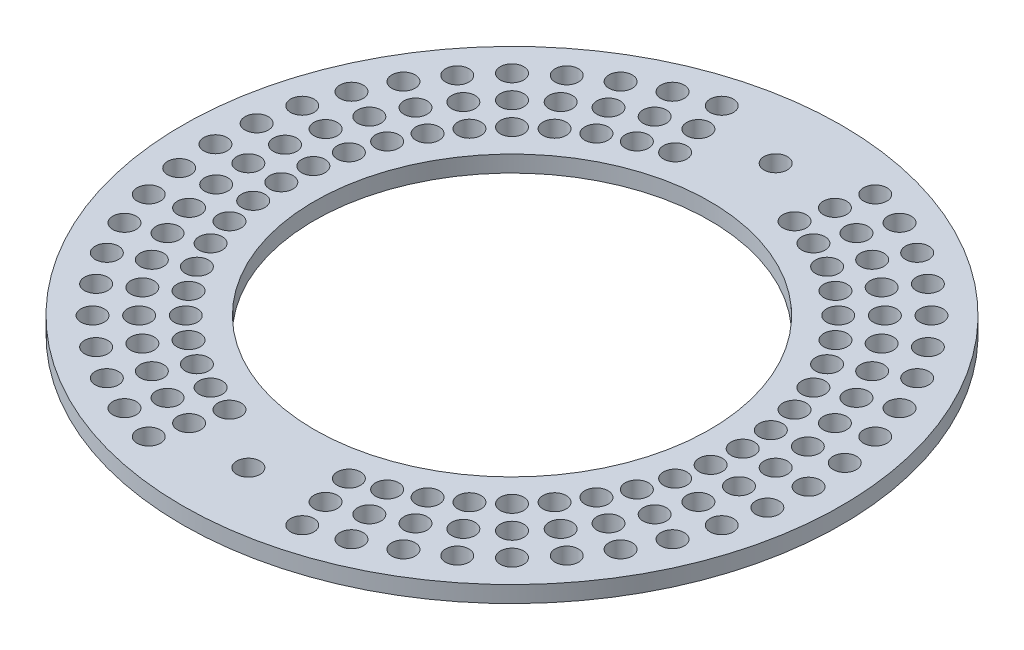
from build123d import *

# Parameters (mm, degrees)
SKETCH1_R                = 63.5
SKETCH1_R_2              = 38.1
BOSS_EXTRUDE1_DEPTH      = 3.175
SKETCH2_R                = 2.2479
CUT_EXTRUDE1_DEPTH       = 90.858670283
SKETCH3_R                = 2.2479
CUT_EXTRUDE2_DEPTH       = 90.858670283
CIRPATTERN1_COUNT        = 21
CIRPATTERN1_ANGLE        = 150
MIRROR1_COPY_1_SKETCH_R  = 2.2479
MIRROR1_COPY_1_DEPTH     = 90.858670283
MIRROR1_COPY_2_SKETCH_R  = 2.2479
MIRROR1_COPY_2_DEPTH     = 90.858670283
MIRROR1_COPY_3_SKETCH_R  = 2.2479
MIRROR1_COPY_3_DEPTH     = 90.858670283
MIRROR1_COPY_4_SKETCH_R  = 2.2479
MIRROR1_COPY_4_DEPTH     = 90.858670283
MIRROR1_COPY_5_SKETCH_R  = 2.2479
MIRROR1_COPY_5_DEPTH     = 90.858670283
MIRROR1_COPY_6_SKETCH_R  = 2.2479
MIRROR1_COPY_6_DEPTH     = 90.858670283
MIRROR1_COPY_7_SKETCH_R  = 2.2479
MIRROR1_COPY_7_DEPTH     = 90.858670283
MIRROR1_COPY_8_SKETCH_R  = 2.2479
MIRROR1_COPY_8_DEPTH     = 90.858670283
MIRROR1_COPY_9_SKETCH_R  = 2.2479
MIRROR1_COPY_9_DEPTH     = 90.858670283
MIRROR1_COPY_10_SKETCH_R = 2.2479
MIRROR1_COPY_10_DEPTH    = 90.858670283
MIRROR1_COPY_11_SKETCH_R = 2.2479
MIRROR1_COPY_11_DEPTH    = 90.858670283
MIRROR1_COPY_12_SKETCH_R = 2.2479
MIRROR1_COPY_12_DEPTH    = 90.858670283
MIRROR1_COPY_13_SKETCH_R = 2.2479
MIRROR1_COPY_13_DEPTH    = 90.858670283
MIRROR1_COPY_14_SKETCH_R = 2.2479
MIRROR1_COPY_14_DEPTH    = 90.858670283
MIRROR1_COPY_15_SKETCH_R = 2.2479
MIRROR1_COPY_15_DEPTH    = 90.858670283
MIRROR1_COPY_16_SKETCH_R = 2.2479
MIRROR1_COPY_16_DEPTH    = 90.858670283
MIRROR1_COPY_17_SKETCH_R = 2.2479
MIRROR1_COPY_17_DEPTH    = 90.858670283
MIRROR1_COPY_18_SKETCH_R = 2.2479
MIRROR1_COPY_18_DEPTH    = 90.858670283
MIRROR1_COPY_19_SKETCH_R = 2.2479
MIRROR1_COPY_19_DEPTH    = 90.858670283
MIRROR1_COPY_20_SKETCH_R = 2.2479
MIRROR1_COPY_20_DEPTH    = 90.858670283


with BuildPart() as part:
    # Sketch1 → Boss-Extrude1 (new body)
    with BuildSketch(Plane(origin=(0, 0, 0), x_dir=(1, 0, 0), z_dir=(0, 1, 0))):
        with Locations(Location((0, 0, 0), (0, 0, 270))):
            Circle(SKETCH1_R)
        with Locations(Location((0, 0, 0), (0, 0, 270))):
            Circle(SKETCH1_R_2, mode=Mode.SUBTRACT)
    extrude(amount=BOSS_EXTRUDE1_DEPTH)

    # Sketch2 → Cut-Extrude1 (cut, through all)
    with BuildSketch(Plane(origin=(0, 3.175, 0), x_dir=(1, 0, 0), z_dir=(0, 1, 0))):
        with Locations(Location((0, 50.8, 0), (0, 0, 270))):
            Circle(SKETCH2_R)
        with Locations(Location((0, -50.8, 0), (0, 0, 270))):
            Circle(SKETCH2_R)
    extrude(amount=-CUT_EXTRUDE1_DEPTH, mode=Mode.SUBTRACT)

    # Sketch3 → Cut-Extrude2 (cut, through all)
    with BuildSketch(Plane(origin=(0, 3.175, 0), x_dir=(1, 0, 0), z_dir=(0, 1, 0))):
        with Locations(Location((-14.791508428, 55.202660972, 0), (0, 0, 270))):
            Circle(SKETCH3_R)
        with Locations(Location((-13.148007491, 49.069031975, 0), (0, 0, 270))):
            Circle(SKETCH3_R)
        with Locations(Location((-11.504506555, 42.935402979, 0), (0, 0, 270))):
            Circle(SKETCH3_R)
    cut_extrude2 = extrude(amount=-CUT_EXTRUDE2_DEPTH, mode=Mode.SUBTRACT)

    # CirPattern1: Cut-Extrude2 ×21 about axis
    cirpattern1_axis = Axis((0, 0, 0), (0, 1, 0))
    for i in range(1, CIRPATTERN1_COUNT):
        add(cut_extrude2.rotate(cirpattern1_axis, i * CIRPATTERN1_ANGLE / (CIRPATTERN1_COUNT - 1)), mode=Mode.SUBTRACT)

    # Mirror1: Cut-Extrude2 across plane
    add(cut_extrude2.mirror(Plane(origin=(0, 0, 0), x_dir=(0, 0, 1), z_dir=(1, 0, 0))), mode=Mode.SUBTRACT)

    # Mirror1 copy 1 sketch → Mirror1 copy 1 (cut, through all)
    with BuildSketch(Plane(origin=(0, 3.175, 0), x_dir=(-0.9914448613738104, 0, -0.13052619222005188), z_dir=(0, 1, 0))):
        with Locations((-14.791508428, -55.202660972)):
            Circle(MIRROR1_COPY_1_SKETCH_R)
        with Locations((-13.148007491, -49.069031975)):
            Circle(MIRROR1_COPY_1_SKETCH_R)
        with Locations((-11.504506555, -42.935402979)):
            Circle(MIRROR1_COPY_1_SKETCH_R)
    extrude(amount=-MIRROR1_COPY_1_DEPTH, mode=Mode.SUBTRACT)

    # Mirror1 copy 2 sketch → Mirror1 copy 2 (cut, through all)
    with BuildSketch(Plane(origin=(0, 3.175, 0), x_dir=(-0.9659258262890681, 0, -0.25881904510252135), z_dir=(0, 1, 0))):
        with Locations((-14.791508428, -55.202660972)):
            Circle(MIRROR1_COPY_2_SKETCH_R)
        with Locations((-13.148007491, -49.069031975)):
            Circle(MIRROR1_COPY_2_SKETCH_R)
        with Locations((-11.504506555, -42.935402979)):
            Circle(MIRROR1_COPY_2_SKETCH_R)
    extrude(amount=-MIRROR1_COPY_2_DEPTH, mode=Mode.SUBTRACT)

    # Mirror1 copy 3 sketch → Mirror1 copy 3 (cut, through all)
    with BuildSketch(Plane(origin=(0, 3.175, 0), x_dir=(-0.9238795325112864, 0, -0.38268343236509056), z_dir=(0, 1, 0))):
        with Locations((-14.791508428, -55.202660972)):
            Circle(MIRROR1_COPY_3_SKETCH_R)
        with Locations((-13.148007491, -49.069031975)):
            Circle(MIRROR1_COPY_3_SKETCH_R)
        with Locations((-11.504506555, -42.935402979)):
            Circle(MIRROR1_COPY_3_SKETCH_R)
    extrude(amount=-MIRROR1_COPY_3_DEPTH, mode=Mode.SUBTRACT)

    # Mirror1 copy 4 sketch → Mirror1 copy 4 (cut, through all)
    with BuildSketch(Plane(origin=(0, 3.175, 0), x_dir=(-0.866025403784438, 0, -0.500000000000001), z_dir=(0, 1, 0))):
        with Locations((-14.791508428, -55.202660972)):
            Circle(MIRROR1_COPY_4_SKETCH_R)
        with Locations((-13.148007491, -49.069031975)):
            Circle(MIRROR1_COPY_4_SKETCH_R)
        with Locations((-11.504506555, -42.935402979)):
            Circle(MIRROR1_COPY_4_SKETCH_R)
    extrude(amount=-MIRROR1_COPY_4_DEPTH, mode=Mode.SUBTRACT)

    # Mirror1 copy 5 sketch → Mirror1 copy 5 (cut, through all)
    with BuildSketch(Plane(origin=(0, 3.175, 0), x_dir=(-0.7933533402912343, 0, -0.6087614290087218), z_dir=(0, 1, 0))):
        with Locations((-14.791508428, -55.202660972)):
            Circle(MIRROR1_COPY_5_SKETCH_R)
        with Locations((-13.148007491, -49.069031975)):
            Circle(MIRROR1_COPY_5_SKETCH_R)
        with Locations((-11.504506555, -42.935402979)):
            Circle(MIRROR1_COPY_5_SKETCH_R)
    extrude(amount=-MIRROR1_COPY_5_DEPTH, mode=Mode.SUBTRACT)

    # Mirror1 copy 6 sketch → Mirror1 copy 6 (cut, through all)
    with BuildSketch(Plane(origin=(0, 3.175, 0), x_dir=(-0.7071067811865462, 0, -0.7071067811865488), z_dir=(0, 1, 0))):
        with Locations((-14.791508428, -55.202660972)):
            Circle(MIRROR1_COPY_6_SKETCH_R)
        with Locations((-13.148007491, -49.069031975)):
            Circle(MIRROR1_COPY_6_SKETCH_R)
        with Locations((-11.504506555, -42.935402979)):
            Circle(MIRROR1_COPY_6_SKETCH_R)
    extrude(amount=-MIRROR1_COPY_6_DEPTH, mode=Mode.SUBTRACT)

    # Mirror1 copy 7 sketch → Mirror1 copy 7 (cut, through all)
    with BuildSketch(Plane(origin=(0, 3.175, 0), x_dir=(-0.608761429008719, 0, -0.7933533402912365), z_dir=(0, 1, 0))):
        with Locations((-14.791508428, -55.202660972)):
            Circle(MIRROR1_COPY_7_SKETCH_R)
        with Locations((-13.148007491, -49.069031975)):
            Circle(MIRROR1_COPY_7_SKETCH_R)
        with Locations((-11.504506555, -42.935402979)):
            Circle(MIRROR1_COPY_7_SKETCH_R)
    extrude(amount=-MIRROR1_COPY_7_DEPTH, mode=Mode.SUBTRACT)

    # Mirror1 copy 8 sketch → Mirror1 copy 8 (cut, through all)
    with BuildSketch(Plane(origin=(0, 3.175, 0), x_dir=(-0.499999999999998, 0, -0.8660254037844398), z_dir=(0, 1, 0))):
        with Locations((-14.791508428, -55.202660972)):
            Circle(MIRROR1_COPY_8_SKETCH_R)
        with Locations((-13.148007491, -49.069031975)):
            Circle(MIRROR1_COPY_8_SKETCH_R)
        with Locations((-11.504506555, -42.935402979)):
            Circle(MIRROR1_COPY_8_SKETCH_R)
    extrude(amount=-MIRROR1_COPY_8_DEPTH, mode=Mode.SUBTRACT)

    # Mirror1 copy 9 sketch → Mirror1 copy 9 (cut, through all)
    with BuildSketch(Plane(origin=(0, 3.175, 0), x_dir=(-0.38268343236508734, 0, -0.9238795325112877), z_dir=(0, 1, 0))):
        with Locations((-14.791508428, -55.202660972)):
            Circle(MIRROR1_COPY_9_SKETCH_R)
        with Locations((-13.148007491, -49.069031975)):
            Circle(MIRROR1_COPY_9_SKETCH_R)
        with Locations((-11.504506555, -42.935402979)):
            Circle(MIRROR1_COPY_9_SKETCH_R)
    extrude(amount=-MIRROR1_COPY_9_DEPTH, mode=Mode.SUBTRACT)

    # Mirror1 copy 10 sketch → Mirror1 copy 10 (cut, through all)
    with BuildSketch(Plane(origin=(0, 3.175, 0), x_dir=(-0.25881904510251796, 0, -0.9659258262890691), z_dir=(0, 1, 0))):
        with Locations((-14.791508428, -55.202660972)):
            Circle(MIRROR1_COPY_10_SKETCH_R)
        with Locations((-13.148007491, -49.069031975)):
            Circle(MIRROR1_COPY_10_SKETCH_R)
        with Locations((-11.504506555, -42.935402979)):
            Circle(MIRROR1_COPY_10_SKETCH_R)
    extrude(amount=-MIRROR1_COPY_10_DEPTH, mode=Mode.SUBTRACT)

    # Mirror1 copy 11 sketch → Mirror1 copy 11 (cut, through all)
    with BuildSketch(Plane(origin=(0, 3.175, 0), x_dir=(-0.1305261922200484, 0, -0.9914448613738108), z_dir=(0, 1, 0))):
        with Locations((-14.791508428, -55.202660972)):
            Circle(MIRROR1_COPY_11_SKETCH_R)
        with Locations((-13.148007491, -49.069031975)):
            Circle(MIRROR1_COPY_11_SKETCH_R)
        with Locations((-11.504506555, -42.935402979)):
            Circle(MIRROR1_COPY_11_SKETCH_R)
    extrude(amount=-MIRROR1_COPY_11_DEPTH, mode=Mode.SUBTRACT)

    # Mirror1 copy 12 sketch → Mirror1 copy 12 (cut, through all)
    with BuildSketch(Plane(origin=(0, 3.175, 0), x_dir=(0, 0, -1), z_dir=(0, 1, 0))):
        with Locations((-14.791508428, -55.202660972)):
            Circle(MIRROR1_COPY_12_SKETCH_R)
        with Locations((-13.148007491, -49.069031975)):
            Circle(MIRROR1_COPY_12_SKETCH_R)
        with Locations((-11.504506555, -42.935402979)):
            Circle(MIRROR1_COPY_12_SKETCH_R)
    extrude(amount=-MIRROR1_COPY_12_DEPTH, mode=Mode.SUBTRACT)

    # Mirror1 copy 13 sketch → Mirror1 copy 13 (cut, through all)
    with BuildSketch(Plane(origin=(0, 3.175, 0), x_dir=(0.13052619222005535, 0, -0.9914448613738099), z_dir=(0, 1, 0))):
        with Locations((-14.791508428, -55.202660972)):
            Circle(MIRROR1_COPY_13_SKETCH_R)
        with Locations((-13.148007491, -49.069031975)):
            Circle(MIRROR1_COPY_13_SKETCH_R)
        with Locations((-11.504506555, -42.935402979)):
            Circle(MIRROR1_COPY_13_SKETCH_R)
    extrude(amount=-MIRROR1_COPY_13_DEPTH, mode=Mode.SUBTRACT)

    # Mirror1 copy 14 sketch → Mirror1 copy 14 (cut, through all)
    with BuildSketch(Plane(origin=(0, 3.175, 0), x_dir=(0.2588190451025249, 0, -0.9659258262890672), z_dir=(0, 1, 0))):
        with Locations((-14.791508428, -55.202660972)):
            Circle(MIRROR1_COPY_14_SKETCH_R)
        with Locations((-13.148007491, -49.069031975)):
            Circle(MIRROR1_COPY_14_SKETCH_R)
        with Locations((-11.504506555, -42.935402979)):
            Circle(MIRROR1_COPY_14_SKETCH_R)
    extrude(amount=-MIRROR1_COPY_14_DEPTH, mode=Mode.SUBTRACT)

    # Mirror1 copy 15 sketch → Mirror1 copy 15 (cut, through all)
    with BuildSketch(Plane(origin=(0, 3.175, 0), x_dir=(0.3826834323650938, 0, -0.9238795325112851), z_dir=(0, 1, 0))):
        with Locations((-14.791508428, -55.202660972)):
            Circle(MIRROR1_COPY_15_SKETCH_R)
        with Locations((-13.148007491, -49.069031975)):
            Circle(MIRROR1_COPY_15_SKETCH_R)
        with Locations((-11.504506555, -42.935402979)):
            Circle(MIRROR1_COPY_15_SKETCH_R)
    extrude(amount=-MIRROR1_COPY_15_DEPTH, mode=Mode.SUBTRACT)

    # Mirror1 copy 16 sketch → Mirror1 copy 16 (cut, through all)
    with BuildSketch(Plane(origin=(0, 3.175, 0), x_dir=(0.500000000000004, 0, -0.8660254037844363), z_dir=(0, 1, 0))):
        with Locations((-14.791508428, -55.202660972)):
            Circle(MIRROR1_COPY_16_SKETCH_R)
        with Locations((-13.148007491, -49.069031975)):
            Circle(MIRROR1_COPY_16_SKETCH_R)
        with Locations((-11.504506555, -42.935402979)):
            Circle(MIRROR1_COPY_16_SKETCH_R)
    extrude(amount=-MIRROR1_COPY_16_DEPTH, mode=Mode.SUBTRACT)

    # Mirror1 copy 17 sketch → Mirror1 copy 17 (cut, through all)
    with BuildSketch(Plane(origin=(0, 3.175, 0), x_dir=(0.6087614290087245, 0, -0.7933533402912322), z_dir=(0, 1, 0))):
        with Locations((-14.791508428, -55.202660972)):
            Circle(MIRROR1_COPY_17_SKETCH_R)
        with Locations((-13.148007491, -49.069031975)):
            Circle(MIRROR1_COPY_17_SKETCH_R)
        with Locations((-11.504506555, -42.935402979)):
            Circle(MIRROR1_COPY_17_SKETCH_R)
    extrude(amount=-MIRROR1_COPY_17_DEPTH, mode=Mode.SUBTRACT)

    # Mirror1 copy 18 sketch → Mirror1 copy 18 (cut, through all)
    with BuildSketch(Plane(origin=(0, 3.175, 0), x_dir=(0.7071067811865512, 0, -0.7071067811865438), z_dir=(0, 1, 0))):
        with Locations((-14.791508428, -55.202660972)):
            Circle(MIRROR1_COPY_18_SKETCH_R)
        with Locations((-13.148007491, -49.069031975)):
            Circle(MIRROR1_COPY_18_SKETCH_R)
        with Locations((-11.504506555, -42.935402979)):
            Circle(MIRROR1_COPY_18_SKETCH_R)
    extrude(amount=-MIRROR1_COPY_18_DEPTH, mode=Mode.SUBTRACT)

    # Mirror1 copy 19 sketch → Mirror1 copy 19 (cut, through all)
    with BuildSketch(Plane(origin=(0, 3.175, 0), x_dir=(0.7933533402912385, 0, -0.6087614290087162), z_dir=(0, 1, 0))):
        with Locations((-14.791508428, -55.202660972)):
            Circle(MIRROR1_COPY_19_SKETCH_R)
        with Locations((-13.148007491, -49.069031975)):
            Circle(MIRROR1_COPY_19_SKETCH_R)
        with Locations((-11.504506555, -42.935402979)):
            Circle(MIRROR1_COPY_19_SKETCH_R)
    extrude(amount=-MIRROR1_COPY_19_DEPTH, mode=Mode.SUBTRACT)

    # Mirror1 copy 20 sketch → Mirror1 copy 20 (cut, through all)
    with BuildSketch(Plane(origin=(0, 3.175, 0), x_dir=(0.8660254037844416, 0, -0.49999999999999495), z_dir=(0, 1, 0))):
        with Locations((-14.791508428, -55.202660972)):
            Circle(MIRROR1_COPY_20_SKETCH_R)
        with Locations((-13.148007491, -49.069031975)):
            Circle(MIRROR1_COPY_20_SKETCH_R)
        with Locations((-11.504506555, -42.935402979)):
            Circle(MIRROR1_COPY_20_SKETCH_R)
    extrude(amount=-MIRROR1_COPY_20_DEPTH, mode=Mode.SUBTRACT)


solid = part.part
